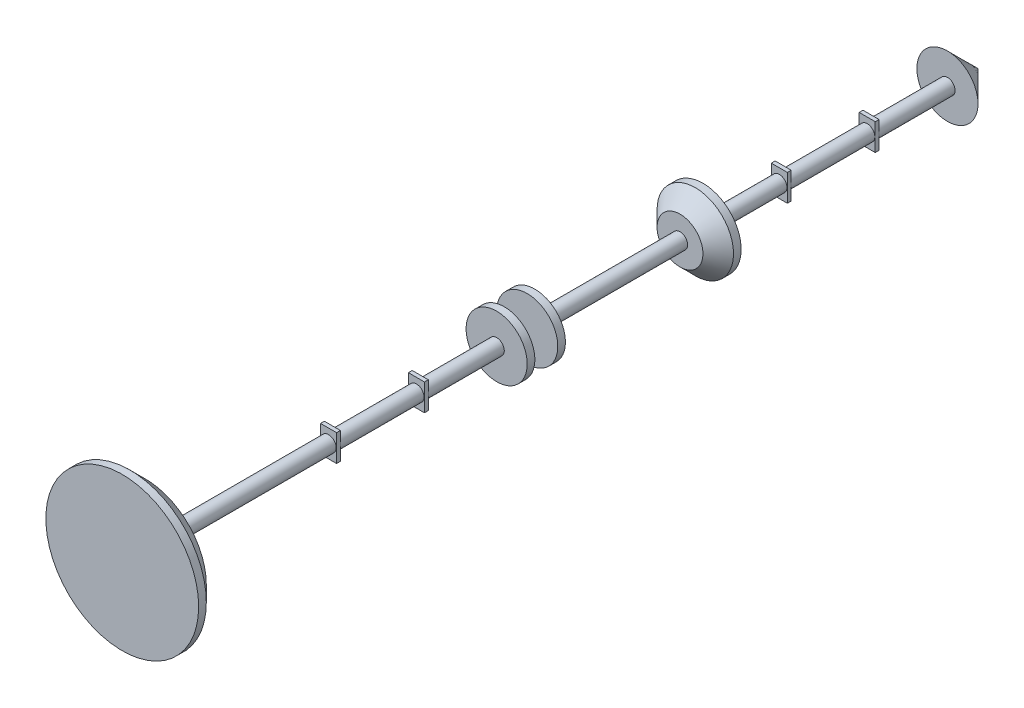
ISO-10303-21;
HEADER;
FILE_DESCRIPTION(('STEP AP214'),'2;1');
FILE_NAME('part.step','',(''),(''),'','','');
FILE_SCHEMA(('AUTOMOTIVE_DESIGN { 1 0 10303 214 1 1 1 1 }'));
ENDSEC;
DATA;
#1=APPLICATION_CONTEXT('core data for automotive mechanical design processes');
#2=APPLICATION_PROTOCOL_DEFINITION('international standard','automotive_design',2000,#1);
#3=PRODUCT_CONTEXT('',#1,'mechanical');
#4=PRODUCT('Part','Part','',(#3));
#5=PRODUCT_RELATED_PRODUCT_CATEGORY('part','',(#4));
#6=PRODUCT_DEFINITION_FORMATION('','',#4);
#7=PRODUCT_DEFINITION_CONTEXT('part definition',#1,'design');
#8=PRODUCT_DEFINITION('design','',#6,#7);
#9=PRODUCT_DEFINITION_SHAPE('','',#8);
#10=(LENGTH_UNIT() NAMED_UNIT(*) SI_UNIT(.MILLI.,.METRE.));
#11=(NAMED_UNIT(*) PLANE_ANGLE_UNIT() SI_UNIT($,.RADIAN.));
#12=(NAMED_UNIT(*) SI_UNIT($,.STERADIAN.) SOLID_ANGLE_UNIT());
#13=UNCERTAINTY_MEASURE_WITH_UNIT(LENGTH_MEASURE(1.E-05),#10,'distance_accuracy_value','');
#14=(GEOMETRIC_REPRESENTATION_CONTEXT(3) GLOBAL_UNCERTAINTY_ASSIGNED_CONTEXT((#13)) GLOBAL_UNIT_ASSIGNED_CONTEXT((#10,
#11,#12)) REPRESENTATION_CONTEXT('',''));
#15=CARTESIAN_POINT('',(0.,0.,0.));
#16=DIRECTION('',(0.,0.,1.));
#17=DIRECTION('',(1.,0.,0.));
#18=AXIS2_PLACEMENT_3D('',#15,#16,#17);
#19=CARTESIAN_POINT('',(0.,0.,-260.));
#20=DIRECTION('',(0.,0.,-1.));
#21=DIRECTION('',(-1.,0.,0.));
#22=AXIS2_PLACEMENT_3D('',#19,#20,#21);
#23=PLANE('',#22);
#24=CARTESIAN_POINT('',(0.,0.,-260.));
#25=DIRECTION('',(0.,0.,-1.));
#26=DIRECTION('',(-1.,0.,0.));
#27=AXIS2_PLACEMENT_3D('',#24,#25,#26);
#28=CIRCLE('',#27,40.);
#29=CARTESIAN_POINT('',(-40.,0.,-260.));
#30=VERTEX_POINT('',#29);
#31=EDGE_CURVE('E413',#30,#30,#28,.T.);
#32=ORIENTED_EDGE('',*,*,#31,.F.);
#33=EDGE_LOOP('',(#32));
#34=FACE_BOUND('',#33,.T.);
#35=ADVANCED_FACE('F42',(#34),#23,.F.);
#36=CARTESIAN_POINT('',(-10.5,-17.5,-710.));
#37=DIRECTION('',(0.,0.,-1.));
#38=DIRECTION('',(-1.,0.,0.));
#39=AXIS2_PLACEMENT_3D('',#36,#37,#38);
#40=PLANE('',#39);
#41=DIRECTION('',(-1.,0.,0.));
#42=VECTOR('',#41,1.);
#43=CARTESIAN_POINT('',(10.5,-17.5,-710.));
#44=LINE('',#43,#42);
#45=CARTESIAN_POINT('',(10.5,-17.5,-710.));
#46=VERTEX_POINT('',#45);
#47=CARTESIAN_POINT('',(-10.5,-17.5,-710.));
#48=VERTEX_POINT('',#47);
#49=EDGE_CURVE('E120',#46,#48,#44,.T.);
#50=ORIENTED_EDGE('',*,*,#49,.T.);
#51=DIRECTION('',(0.,1.,0.));
#52=VECTOR('',#51,1.);
#53=CARTESIAN_POINT('',(-10.5,-17.5,-710.));
#54=LINE('',#53,#52);
#55=CARTESIAN_POINT('',(-10.5,17.5,-710.));
#56=VERTEX_POINT('',#55);
#57=EDGE_CURVE('E112',#48,#56,#54,.T.);
#58=ORIENTED_EDGE('',*,*,#57,.T.);
#59=DIRECTION('',(1.,0.,0.));
#60=VECTOR('',#59,1.);
#61=CARTESIAN_POINT('',(-10.5,17.5,-710.));
#62=LINE('',#61,#60);
#63=CARTESIAN_POINT('',(10.5,17.5,-710.));
#64=VERTEX_POINT('',#63);
#65=EDGE_CURVE('E117',#56,#64,#62,.T.);
#66=ORIENTED_EDGE('',*,*,#65,.T.);
#67=DIRECTION('',(0.,-1.,0.));
#68=VECTOR('',#67,1.);
#69=CARTESIAN_POINT('',(10.5,17.5,-710.));
#70=LINE('',#69,#68);
#71=EDGE_CURVE('E133',#64,#46,#70,.T.);
#72=ORIENTED_EDGE('',*,*,#71,.T.);
#73=EDGE_LOOP('',(#50,#58,#66,#72));
#74=FACE_BOUND('',#73,.T.);
#75=CARTESIAN_POINT('',(0.,0.,-710.));
#76=DIRECTION('',(0.,0.,-1.));
#77=DIRECTION('',(-1.,0.,0.));
#78=AXIS2_PLACEMENT_3D('',#75,#76,#77);
#79=CIRCLE('',#78,10.);
#80=CARTESIAN_POINT('',(-10.,0.,-710.));
#81=VERTEX_POINT('',#80);
#82=EDGE_CURVE('E153',#81,#81,#79,.T.);
#83=ORIENTED_EDGE('',*,*,#82,.F.);
#84=EDGE_LOOP('',(#83));
#85=FACE_BOUND('',#84,.T.);
#86=ADVANCED_FACE('F114',(#74,#85),#40,.T.);
#87=CARTESIAN_POINT('',(-10.5,-17.5,-595.));
#88=DIRECTION('',(0.,0.,1.));
#89=DIRECTION('',(1.,0.,0.));
#90=AXIS2_PLACEMENT_3D('',#87,#88,#89);
#91=PLANE('',#90);
#92=DIRECTION('',(0.,1.,0.));
#93=VECTOR('',#92,1.);
#94=CARTESIAN_POINT('',(-10.5,-17.5,-595.));
#95=LINE('',#94,#93);
#96=CARTESIAN_POINT('',(-10.5,-17.5,-595.));
#97=VERTEX_POINT('',#96);
#98=CARTESIAN_POINT('',(-10.5,17.5,-595.));
#99=VERTEX_POINT('',#98);
#100=EDGE_CURVE('E135',#97,#99,#95,.T.);
#101=ORIENTED_EDGE('',*,*,#100,.T.);
#102=DIRECTION('',(1.,0.,0.));
#103=VECTOR('',#102,1.);
#104=CARTESIAN_POINT('',(-10.5,17.5,-595.));
#105=LINE('',#104,#103);
#106=CARTESIAN_POINT('',(10.5,17.5,-595.));
#107=VERTEX_POINT('',#106);
#108=EDGE_CURVE('E453',#99,#107,#105,.T.);
#109=ORIENTED_EDGE('',*,*,#108,.T.);
#110=DIRECTION('',(0.,-1.,0.));
#111=VECTOR('',#110,1.);
#112=CARTESIAN_POINT('',(10.5,17.5,-595.));
#113=LINE('',#112,#111);
#114=CARTESIAN_POINT('',(10.5,-17.5,-595.));
#115=VERTEX_POINT('',#114);
#116=EDGE_CURVE('E450',#107,#115,#113,.T.);
#117=ORIENTED_EDGE('',*,*,#116,.T.);
#118=DIRECTION('',(-1.,0.,0.));
#119=VECTOR('',#118,1.);
#120=CARTESIAN_POINT('',(10.5,-17.5,-595.));
#121=LINE('',#120,#119);
#122=EDGE_CURVE('E428',#115,#97,#121,.T.);
#123=ORIENTED_EDGE('',*,*,#122,.T.);
#124=EDGE_LOOP('',(#101,#109,#117,#123));
#125=FACE_BOUND('',#124,.T.);
#126=CARTESIAN_POINT('',(0.,0.,-595.));
#127=DIRECTION('',(0.,0.,1.));
#128=DIRECTION('',(1.,0.,0.));
#129=AXIS2_PLACEMENT_3D('',#126,#127,#128);
#130=CIRCLE('',#129,10.);
#131=CARTESIAN_POINT('',(10.,0.,-595.));
#132=VERTEX_POINT('',#131);
#133=EDGE_CURVE('E445',#132,#132,#130,.F.);
#134=ORIENTED_EDGE('',*,*,#133,.F.);
#135=EDGE_LOOP('',(#134));
#136=FACE_BOUND('',#135,.T.);
#137=ADVANCED_FACE('F180',(#125,#136),#91,.F.);
#138=CARTESIAN_POINT('',(0.,0.,-490.));
#139=DIRECTION('',(0.,0.,-1.));
#140=DIRECTION('',(-1.,0.,0.));
#141=AXIS2_PLACEMENT_3D('',#138,#139,#140);
#142=PLANE('',#141);
#143=CARTESIAN_POINT('',(0.,0.,-490.));
#144=DIRECTION('',(0.,0.,-1.));
#145=DIRECTION('',(-1.,0.,0.));
#146=AXIS2_PLACEMENT_3D('',#143,#144,#145);
#147=CIRCLE('',#146,50.);
#148=CARTESIAN_POINT('',(-50.,0.,-490.));
#149=VERTEX_POINT('',#148);
#150=EDGE_CURVE('E419',#149,#149,#147,.T.);
#151=ORIENTED_EDGE('',*,*,#150,.T.);
#152=EDGE_LOOP('',(#151));
#153=FACE_BOUND('',#152,.T.);
#154=CARTESIAN_POINT('',(0.,0.,-490.));
#155=DIRECTION('',(0.,0.,-1.));
#156=DIRECTION('',(-1.,0.,0.));
#157=AXIS2_PLACEMENT_3D('',#154,#155,#156);
#158=CIRCLE('',#157,10.);
#159=CARTESIAN_POINT('',(-10.,0.,-490.));
#160=VERTEX_POINT('',#159);
#161=EDGE_CURVE('E424',#160,#160,#158,.T.);
#162=ORIENTED_EDGE('',*,*,#161,.F.);
#163=EDGE_LOOP('',(#162));
#164=FACE_BOUND('',#163,.T.);
#165=ADVANCED_FACE('F195',(#153,#164),#142,.T.);
#166=CARTESIAN_POINT('',(0.,0.,-270.));
#167=DIRECTION('',(0.,0.,-1.));
#168=DIRECTION('',(-1.,0.,0.));
#169=AXIS2_PLACEMENT_3D('',#166,#167,#168);
#170=PLANE('',#169);
#171=CARTESIAN_POINT('',(0.,0.,-270.));
#172=DIRECTION('',(0.,0.,-1.));
#173=DIRECTION('',(-1.,0.,0.));
#174=AXIS2_PLACEMENT_3D('',#171,#172,#173);
#175=CIRCLE('',#174,40.);
#176=CARTESIAN_POINT('',(-40.,0.,-270.));
#177=VERTEX_POINT('',#176);
#178=EDGE_CURVE('E411',#177,#177,#175,.T.);
#179=ORIENTED_EDGE('',*,*,#178,.T.);
#180=EDGE_LOOP('',(#179));
#181=FACE_BOUND('',#180,.T.);
#182=CARTESIAN_POINT('',(0.,0.,-270.));
#183=DIRECTION('',(0.,0.,-1.));
#184=DIRECTION('',(-1.,0.,0.));
#185=AXIS2_PLACEMENT_3D('',#182,#183,#184);
#186=CIRCLE('',#185,10.);
#187=CARTESIAN_POINT('',(-10.,0.,-270.));
#188=VERTEX_POINT('',#187);
#189=EDGE_CURVE('E414',#188,#188,#186,.T.);
#190=ORIENTED_EDGE('',*,*,#189,.F.);
#191=EDGE_LOOP('',(#190));
#192=FACE_BOUND('',#191,.T.);
#193=ADVANCED_FACE('F185',(#181,#192),#170,.T.);
#194=CARTESIAN_POINT('',(0.,0.,-270.));
#195=DIRECTION('',(0.,0.,1.));
#196=DIRECTION('',(1.,0.,0.));
#197=AXIS2_PLACEMENT_3D('',#194,#195,#196);
#198=CYLINDRICAL_SURFACE('',#197,40.);
#199=ORIENTED_EDGE('',*,*,#178,.F.);
#200=EDGE_LOOP('',(#199));
#201=FACE_BOUND('',#200,.T.);
#202=ORIENTED_EDGE('',*,*,#31,.T.);
#203=EDGE_LOOP('',(#202));
#204=FACE_BOUND('',#203,.T.);
#205=ADVANCED_FACE('F190',(#201,#204),#198,.T.);
#206=CARTESIAN_POINT('',(0.,0.,-460.));
#207=DIRECTION('',(0.,0.,1.));
#208=DIRECTION('',(1.,0.,0.));
#209=AXIS2_PLACEMENT_3D('',#206,#207,#208);
#210=CYLINDRICAL_SURFACE('',#209,10.);
#211=CARTESIAN_POINT('',(0.,0.,-460.));
#212=DIRECTION('',(0.,0.,-1.));
#213=DIRECTION('',(-1.,0.,0.));
#214=AXIS2_PLACEMENT_3D('',#211,#212,#213);
#215=CIRCLE('',#214,10.);
#216=CARTESIAN_POINT('',(-10.,0.,-460.));
#217=VERTEX_POINT('',#216);
#218=EDGE_CURVE('E417',#217,#217,#215,.T.);
#219=ORIENTED_EDGE('',*,*,#218,.F.);
#220=EDGE_LOOP('',(#219));
#221=FACE_BOUND('',#220,.T.);
#222=ORIENTED_EDGE('',*,*,#189,.T.);
#223=EDGE_LOOP('',(#222));
#224=FACE_BOUND('',#223,.T.);
#225=ADVANCED_FACE('F186',(#221,#224),#210,.T.);
#226=CARTESIAN_POINT('',(0.,0.,-460.));
#227=DIRECTION('',(0.,0.,-1.));
#228=DIRECTION('',(-1.,0.,0.));
#229=AXIS2_PLACEMENT_3D('',#226,#227,#228);
#230=PLANE('',#229);
#231=CARTESIAN_POINT('',(0.,0.,-460.));
#232=DIRECTION('',(0.,0.,-1.));
#233=DIRECTION('',(-1.,0.,0.));
#234=AXIS2_PLACEMENT_3D('',#231,#232,#233);
#235=CIRCLE('',#234,30.);
#236=CARTESIAN_POINT('',(-30.,0.,-460.));
#237=VERTEX_POINT('',#236);
#238=EDGE_CURVE('E12',#237,#237,#235,.F.);
#239=ORIENTED_EDGE('',*,*,#238,.T.);
#240=EDGE_LOOP('',(#239));
#241=FACE_BOUND('',#240,.T.);
#242=ORIENTED_EDGE('',*,*,#218,.T.);
#243=EDGE_LOOP('',(#242));
#244=FACE_BOUND('',#243,.T.);
#245=ADVANCED_FACE('F189',(#241,#244),#230,.F.);
#246=CARTESIAN_POINT('',(0.,0.,-490.));
#247=DIRECTION('',(0.,0.,1.));
#248=DIRECTION('',(1.,0.,0.));
#249=AXIS2_PLACEMENT_3D('',#246,#247,#248);
#250=CYLINDRICAL_SURFACE('',#249,50.);
#251=CARTESIAN_POINT('',(0.,0.,-480.));
#252=DIRECTION('',(0.,0.,-1.));
#253=DIRECTION('',(-1.,0.,0.));
#254=AXIS2_PLACEMENT_3D('',#251,#252,#253);
#255=CIRCLE('',#254,50.);
#256=CARTESIAN_POINT('',(-50.,0.,-480.));
#257=VERTEX_POINT('',#256);
#258=EDGE_CURVE('E50',#257,#257,#255,.T.);
#259=ORIENTED_EDGE('',*,*,#258,.T.);
#260=EDGE_LOOP('',(#259));
#261=FACE_BOUND('',#260,.T.);
#262=ORIENTED_EDGE('',*,*,#150,.F.);
#263=EDGE_LOOP('',(#262));
#264=FACE_BOUND('',#263,.T.);
#265=ADVANCED_FACE('F160',(#261,#264),#250,.T.);
#266=CARTESIAN_POINT('',(0.,0.,-590.));
#267=DIRECTION('',(0.,0.,1.));
#268=DIRECTION('',(1.,0.,0.));
#269=AXIS2_PLACEMENT_3D('',#266,#267,#268);
#270=CYLINDRICAL_SURFACE('',#269,10.);
#271=CARTESIAN_POINT('',(0.,0.,-590.));
#272=DIRECTION('',(0.,0.,-1.));
#273=DIRECTION('',(-1.,0.,0.));
#274=AXIS2_PLACEMENT_3D('',#271,#272,#273);
#275=CIRCLE('',#274,10.);
#276=CARTESIAN_POINT('',(-10.,0.,-590.));
#277=VERTEX_POINT('',#276);
#278=EDGE_CURVE('E429',#277,#277,#275,.T.);
#279=ORIENTED_EDGE('',*,*,#278,.F.);
#280=EDGE_LOOP('',(#279));
#281=FACE_BOUND('',#280,.T.);
#282=ORIENTED_EDGE('',*,*,#161,.T.);
#283=EDGE_LOOP('',(#282));
#284=FACE_BOUND('',#283,.T.);
#285=ADVANCED_FACE('F194',(#281,#284),#270,.T.);
#286=CARTESIAN_POINT('',(-10.5,-17.5,-590.));
#287=DIRECTION('',(0.,0.,1.));
#288=DIRECTION('',(1.,0.,0.));
#289=AXIS2_PLACEMENT_3D('',#286,#287,#288);
#290=PLANE('',#289);
#291=DIRECTION('',(0.,1.,0.));
#292=VECTOR('',#291,1.);
#293=CARTESIAN_POINT('',(-10.5,-17.5,-590.));
#294=LINE('',#293,#292);
#295=CARTESIAN_POINT('',(-10.5,-17.5,-590.));
#296=VERTEX_POINT('',#295);
#297=CARTESIAN_POINT('',(-10.5,17.5,-590.));
#298=VERTEX_POINT('',#297);
#299=EDGE_CURVE('E432',#296,#298,#294,.T.);
#300=ORIENTED_EDGE('',*,*,#299,.F.);
#301=DIRECTION('',(-1.,0.,0.));
#302=VECTOR('',#301,1.);
#303=CARTESIAN_POINT('',(10.5,-17.5,-590.));
#304=LINE('',#303,#302);
#305=CARTESIAN_POINT('',(10.5,-17.5,-590.));
#306=VERTEX_POINT('',#305);
#307=EDGE_CURVE('E86',#306,#296,#304,.T.);
#308=ORIENTED_EDGE('',*,*,#307,.F.);
#309=DIRECTION('',(0.,-1.,0.));
#310=VECTOR('',#309,1.);
#311=CARTESIAN_POINT('',(10.5,17.5,-590.));
#312=LINE('',#311,#310);
#313=CARTESIAN_POINT('',(10.5,17.5,-590.));
#314=VERTEX_POINT('',#313);
#315=EDGE_CURVE('E438',#314,#306,#312,.T.);
#316=ORIENTED_EDGE('',*,*,#315,.F.);
#317=DIRECTION('',(1.,0.,0.));
#318=VECTOR('',#317,1.);
#319=CARTESIAN_POINT('',(-10.5,17.5,-590.));
#320=LINE('',#319,#318);
#321=EDGE_CURVE('E439',#298,#314,#320,.T.);
#322=ORIENTED_EDGE('',*,*,#321,.F.);
#323=EDGE_LOOP('',(#300,#308,#316,#322));
#324=FACE_BOUND('',#323,.T.);
#325=ORIENTED_EDGE('',*,*,#278,.T.);
#326=EDGE_LOOP('',(#325));
#327=FACE_BOUND('',#326,.T.);
#328=ADVANCED_FACE('F204',(#324,#327),#290,.T.);
#329=CARTESIAN_POINT('',(-10.5,-17.5,-595.));
#330=DIRECTION('',(1.,0.,0.));
#331=DIRECTION('',(0.,1.,0.));
#332=AXIS2_PLACEMENT_3D('',#329,#330,#331);
#333=PLANE('',#332);
#334=ORIENTED_EDGE('',*,*,#299,.T.);
#335=DIRECTION('',(0.,0.,1.));
#336=VECTOR('',#335,1.);
#337=CARTESIAN_POINT('',(-10.5,17.5,-595.));
#338=LINE('',#337,#336);
#339=EDGE_CURVE('E435',#99,#298,#338,.T.);
#340=ORIENTED_EDGE('',*,*,#339,.F.);
#341=ORIENTED_EDGE('',*,*,#100,.F.);
#342=DIRECTION('',(0.,0.,1.));
#343=VECTOR('',#342,1.);
#344=CARTESIAN_POINT('',(-10.5,-17.5,-595.));
#345=LINE('',#344,#343);
#346=EDGE_CURVE('E446',#97,#296,#345,.T.);
#347=ORIENTED_EDGE('',*,*,#346,.T.);
#348=EDGE_LOOP('',(#334,#340,#341,#347));
#349=FACE_BOUND('',#348,.T.);
#350=ADVANCED_FACE('F206',(#349),#333,.F.);
#351=CARTESIAN_POINT('',(-10.5,17.5,-595.));
#352=DIRECTION('',(0.,-1.,0.));
#353=DIRECTION('',(1.,0.,0.));
#354=AXIS2_PLACEMENT_3D('',#351,#352,#353);
#355=PLANE('',#354);
#356=ORIENTED_EDGE('',*,*,#321,.T.);
#357=DIRECTION('',(0.,0.,1.));
#358=VECTOR('',#357,1.);
#359=CARTESIAN_POINT('',(10.5,17.5,-595.));
#360=LINE('',#359,#358);
#361=EDGE_CURVE('E440',#107,#314,#360,.T.);
#362=ORIENTED_EDGE('',*,*,#361,.F.);
#363=ORIENTED_EDGE('',*,*,#108,.F.);
#364=ORIENTED_EDGE('',*,*,#339,.T.);
#365=EDGE_LOOP('',(#356,#362,#363,#364));
#366=FACE_BOUND('',#365,.T.);
#367=ADVANCED_FACE('F209',(#366),#355,.F.);
#368=CARTESIAN_POINT('',(10.5,17.5,-595.));
#369=DIRECTION('',(-1.,0.,0.));
#370=DIRECTION('',(0.,-1.,0.));
#371=AXIS2_PLACEMENT_3D('',#368,#369,#370);
#372=PLANE('',#371);
#373=ORIENTED_EDGE('',*,*,#315,.T.);
#374=DIRECTION('',(0.,0.,1.));
#375=VECTOR('',#374,1.);
#376=CARTESIAN_POINT('',(10.5,-17.5,-595.));
#377=LINE('',#376,#375);
#378=EDGE_CURVE('E443',#115,#306,#377,.T.);
#379=ORIENTED_EDGE('',*,*,#378,.F.);
#380=ORIENTED_EDGE('',*,*,#116,.F.);
#381=ORIENTED_EDGE('',*,*,#361,.T.);
#382=EDGE_LOOP('',(#373,#379,#380,#381));
#383=FACE_BOUND('',#382,.T.);
#384=ADVANCED_FACE('F213',(#383),#372,.F.);
#385=CARTESIAN_POINT('',(10.5,-17.5,-595.));
#386=DIRECTION('',(0.,1.,0.));
#387=DIRECTION('',(-1.,0.,0.));
#388=AXIS2_PLACEMENT_3D('',#385,#386,#387);
#389=PLANE('',#388);
#390=ORIENTED_EDGE('',*,*,#307,.T.);
#391=ORIENTED_EDGE('',*,*,#346,.F.);
#392=ORIENTED_EDGE('',*,*,#122,.F.);
#393=ORIENTED_EDGE('',*,*,#378,.T.);
#394=EDGE_LOOP('',(#390,#391,#392,#393));
#395=FACE_BOUND('',#394,.T.);
#396=ADVANCED_FACE('F217',(#395),#389,.F.);
#397=CARTESIAN_POINT('',(0.,0.,-705.));
#398=DIRECTION('',(0.,0.,1.));
#399=DIRECTION('',(1.,0.,0.));
#400=AXIS2_PLACEMENT_3D('',#397,#398,#399);
#401=CYLINDRICAL_SURFACE('',#400,10.);
#402=CARTESIAN_POINT('',(0.,0.,-705.));
#403=DIRECTION('',(0.,0.,-1.));
#404=DIRECTION('',(-1.,0.,0.));
#405=AXIS2_PLACEMENT_3D('',#402,#403,#404);
#406=CIRCLE('',#405,10.);
#407=CARTESIAN_POINT('',(-10.,0.,-705.));
#408=VERTEX_POINT('',#407);
#409=EDGE_CURVE('E148',#408,#408,#406,.T.);
#410=ORIENTED_EDGE('',*,*,#409,.F.);
#411=EDGE_LOOP('',(#410));
#412=FACE_BOUND('',#411,.T.);
#413=ORIENTED_EDGE('',*,*,#133,.T.);
#414=EDGE_LOOP('',(#413));
#415=FACE_BOUND('',#414,.T.);
#416=ADVANCED_FACE('F221',(#412,#415),#401,.T.);
#417=CARTESIAN_POINT('',(-10.5,-17.5,-705.));
#418=DIRECTION('',(0.,0.,-1.));
#419=DIRECTION('',(-1.,0.,0.));
#420=AXIS2_PLACEMENT_3D('',#417,#418,#419);
#421=PLANE('',#420);
#422=DIRECTION('',(-1.,0.,0.));
#423=VECTOR('',#422,1.);
#424=CARTESIAN_POINT('',(10.5,-17.5,-705.));
#425=LINE('',#424,#423);
#426=CARTESIAN_POINT('',(10.5,-17.5,-705.));
#427=VERTEX_POINT('',#426);
#428=CARTESIAN_POINT('',(-10.5,-17.5,-705.));
#429=VERTEX_POINT('',#428);
#430=EDGE_CURVE('E145',#427,#429,#425,.T.);
#431=ORIENTED_EDGE('',*,*,#430,.F.);
#432=DIRECTION('',(0.,-1.,0.));
#433=VECTOR('',#432,1.);
#434=CARTESIAN_POINT('',(10.5,17.5,-705.));
#435=LINE('',#434,#433);
#436=CARTESIAN_POINT('',(10.5,17.5,-705.));
#437=VERTEX_POINT('',#436);
#438=EDGE_CURVE('E61',#437,#427,#435,.T.);
#439=ORIENTED_EDGE('',*,*,#438,.F.);
#440=DIRECTION('',(1.,0.,0.));
#441=VECTOR('',#440,1.);
#442=CARTESIAN_POINT('',(-10.5,17.5,-705.));
#443=LINE('',#442,#441);
#444=CARTESIAN_POINT('',(-10.5,17.5,-705.));
#445=VERTEX_POINT('',#444);
#446=EDGE_CURVE('E128',#445,#437,#443,.T.);
#447=ORIENTED_EDGE('',*,*,#446,.F.);
#448=DIRECTION('',(0.,1.,0.));
#449=VECTOR('',#448,1.);
#450=CARTESIAN_POINT('',(-10.5,-17.5,-705.));
#451=LINE('',#450,#449);
#452=EDGE_CURVE('E77',#429,#445,#451,.T.);
#453=ORIENTED_EDGE('',*,*,#452,.F.);
#454=EDGE_LOOP('',(#431,#439,#447,#453));
#455=FACE_BOUND('',#454,.T.);
#456=ORIENTED_EDGE('',*,*,#409,.T.);
#457=EDGE_LOOP('',(#456));
#458=FACE_BOUND('',#457,.T.);
#459=ADVANCED_FACE('F230',(#455,#458),#421,.F.);
#460=CARTESIAN_POINT('',(10.5,-17.5,-710.));
#461=DIRECTION('',(0.,1.,0.));
#462=DIRECTION('',(-1.,0.,0.));
#463=AXIS2_PLACEMENT_3D('',#460,#461,#462);
#464=PLANE('',#463);
#465=ORIENTED_EDGE('',*,*,#430,.T.);
#466=DIRECTION('',(0.,0.,1.));
#467=VECTOR('',#466,1.);
#468=CARTESIAN_POINT('',(-10.5,-17.5,-710.));
#469=LINE('',#468,#467);
#470=EDGE_CURVE('E142',#48,#429,#469,.T.);
#471=ORIENTED_EDGE('',*,*,#470,.F.);
#472=ORIENTED_EDGE('',*,*,#49,.F.);
#473=DIRECTION('',(0.,0.,1.));
#474=VECTOR('',#473,1.);
#475=CARTESIAN_POINT('',(10.5,-17.5,-710.));
#476=LINE('',#475,#474);
#477=EDGE_CURVE('E144',#46,#427,#476,.T.);
#478=ORIENTED_EDGE('',*,*,#477,.T.);
#479=EDGE_LOOP('',(#465,#471,#472,#478));
#480=FACE_BOUND('',#479,.T.);
#481=ADVANCED_FACE('F232',(#480),#464,.F.);
#482=CARTESIAN_POINT('',(-10.5,-17.5,-710.));
#483=DIRECTION('',(1.,0.,0.));
#484=DIRECTION('',(0.,1.,0.));
#485=AXIS2_PLACEMENT_3D('',#482,#483,#484);
#486=PLANE('',#485);
#487=ORIENTED_EDGE('',*,*,#452,.T.);
#488=DIRECTION('',(0.,0.,1.));
#489=VECTOR('',#488,1.);
#490=CARTESIAN_POINT('',(-10.5,17.5,-710.));
#491=LINE('',#490,#489);
#492=EDGE_CURVE('E125',#56,#445,#491,.T.);
#493=ORIENTED_EDGE('',*,*,#492,.F.);
#494=ORIENTED_EDGE('',*,*,#57,.F.);
#495=ORIENTED_EDGE('',*,*,#470,.T.);
#496=EDGE_LOOP('',(#487,#493,#494,#495));
#497=FACE_BOUND('',#496,.T.);
#498=ADVANCED_FACE('F126',(#497),#486,.F.);
#499=CARTESIAN_POINT('',(-10.5,17.5,-710.));
#500=DIRECTION('',(0.,-1.,0.));
#501=DIRECTION('',(1.,0.,0.));
#502=AXIS2_PLACEMENT_3D('',#499,#500,#501);
#503=PLANE('',#502);
#504=ORIENTED_EDGE('',*,*,#446,.T.);
#505=DIRECTION('',(0.,0.,1.));
#506=VECTOR('',#505,1.);
#507=CARTESIAN_POINT('',(10.5,17.5,-710.));
#508=LINE('',#507,#506);
#509=EDGE_CURVE('E131',#64,#437,#508,.T.);
#510=ORIENTED_EDGE('',*,*,#509,.F.);
#511=ORIENTED_EDGE('',*,*,#65,.F.);
#512=ORIENTED_EDGE('',*,*,#492,.T.);
#513=EDGE_LOOP('',(#504,#510,#511,#512));
#514=FACE_BOUND('',#513,.T.);
#515=ADVANCED_FACE('F130',(#514),#503,.F.);
#516=CARTESIAN_POINT('',(10.5,17.5,-710.));
#517=DIRECTION('',(-1.,0.,0.));
#518=DIRECTION('',(0.,-1.,0.));
#519=AXIS2_PLACEMENT_3D('',#516,#517,#518);
#520=PLANE('',#519);
#521=ORIENTED_EDGE('',*,*,#438,.T.);
#522=ORIENTED_EDGE('',*,*,#477,.F.);
#523=ORIENTED_EDGE('',*,*,#71,.F.);
#524=ORIENTED_EDGE('',*,*,#509,.T.);
#525=EDGE_LOOP('',(#521,#522,#523,#524));
#526=FACE_BOUND('',#525,.T.);
#527=ADVANCED_FACE('F240',(#526),#520,.F.);
#528=CARTESIAN_POINT('',(0.,0.,-810.));
#529=DIRECTION('',(0.,0.,1.));
#530=DIRECTION('',(1.,0.,0.));
#531=AXIS2_PLACEMENT_3D('',#528,#529,#530);
#532=CYLINDRICAL_SURFACE('',#531,10.);
#533=CARTESIAN_POINT('',(0.,0.,-810.));
#534=DIRECTION('',(0.,0.,-1.));
#535=DIRECTION('',(-1.,0.,0.));
#536=AXIS2_PLACEMENT_3D('',#533,#534,#535);
#537=CIRCLE('',#536,10.);
#538=CARTESIAN_POINT('',(-10.,0.,-810.));
#539=VERTEX_POINT('',#538);
#540=EDGE_CURVE('E149',#539,#539,#537,.T.);
#541=ORIENTED_EDGE('',*,*,#540,.F.);
#542=EDGE_LOOP('',(#541));
#543=FACE_BOUND('',#542,.T.);
#544=ORIENTED_EDGE('',*,*,#82,.T.);
#545=EDGE_LOOP('',(#544));
#546=FACE_BOUND('',#545,.T.);
#547=ADVANCED_FACE('F242',(#543,#546),#532,.T.);
#548=CARTESIAN_POINT('',(-40.,0.,-810.));
#549=DIRECTION('',(0.,0.,-1.));
#550=DIRECTION('',(-1.,0.,0.));
#551=AXIS2_PLACEMENT_3D('',#548,#549,#550);
#552=PLANE('',#551);
#553=CARTESIAN_POINT('',(0.,0.,-810.));
#554=DIRECTION('',(0.,0.,1.));
#555=DIRECTION('',(1.,0.,0.));
#556=AXIS2_PLACEMENT_3D('',#553,#554,#555);
#557=CIRCLE('',#556,40.);
#558=CARTESIAN_POINT('',(40.,0.,-810.));
#559=VERTEX_POINT('',#558);
#560=EDGE_CURVE('E152',#559,#559,#557,.T.);
#561=ORIENTED_EDGE('',*,*,#560,.T.);
#562=EDGE_LOOP('',(#561));
#563=FACE_BOUND('',#562,.T.);
#564=ORIENTED_EDGE('',*,*,#540,.T.);
#565=EDGE_LOOP('',(#564));
#566=FACE_BOUND('',#565,.T.);
#567=ADVANCED_FACE('F170',(#563,#566),#552,.F.);
#568=CARTESIAN_POINT('',(0.,0.,-850.));
#569=DIRECTION('',(0.,0.,1.));
#570=DIRECTION('',(1.,0.,0.));
#571=AXIS2_PLACEMENT_3D('',#568,#569,#570);
#572=CONICAL_SURFACE('',#571,0.,0.785398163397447);
#573=ORIENTED_EDGE('',*,*,#560,.F.);
#574=EDGE_LOOP('',(#573));
#575=FACE_BOUND('',#574,.T.);
#576=CARTESIAN_POINT('',(0.,0.,-850.));
#577=VERTEX_POINT('',#576);
#578=VERTEX_LOOP('',#577);
#579=FACE_BOUND('',#578,.T.);
#580=ADVANCED_FACE('F44',(#575,#579),#572,.T.);
#581=CARTESIAN_POINT('',(0.,0.,-480.));
#582=DIRECTION('',(0.,0.,-1.));
#583=DIRECTION('',(-1.,0.,0.));
#584=AXIS2_PLACEMENT_3D('',#581,#582,#583);
#585=CONICAL_SURFACE('',#584,50.,0.78539816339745);
#586=ORIENTED_EDGE('',*,*,#238,.F.);
#587=EDGE_LOOP('',(#586));
#588=FACE_BOUND('',#587,.T.);
#589=ORIENTED_EDGE('',*,*,#258,.F.);
#590=EDGE_LOOP('',(#589));
#591=FACE_BOUND('',#590,.T.);
#592=ADVANCED_FACE('F163',(#588,#591),#585,.T.);
#593=CLOSED_SHELL('',(#35,#86,#137,#165,#193,#205,#225,#245,#265,#285,#328,#350,#367,#384,#396,
#416,#459,#481,#498,#515,#527,#547,#567,#580,#592));
#594=MANIFOLD_SOLID_BREP('B2',#593);
#595=CARTESIAN_POINT('',(0.,0.,270.));
#596=DIRECTION('',(0.,0.,1.));
#597=DIRECTION('',(1.,0.,0.));
#598=AXIS2_PLACEMENT_3D('',#595,#596,#597);
#599=PLANE('',#598);
#600=CARTESIAN_POINT('',(0.,0.,270.));
#601=DIRECTION('',(0.,0.,1.));
#602=DIRECTION('',(1.,0.,0.));
#603=AXIS2_PLACEMENT_3D('',#600,#601,#602);
#604=CIRCLE('',#603,100.);
#605=CARTESIAN_POINT('',(100.,0.,270.));
#606=VERTEX_POINT('',#605);
#607=EDGE_CURVE('E883',#606,#606,#604,.T.);
#608=ORIENTED_EDGE('',*,*,#607,.T.);
#609=EDGE_LOOP('',(#608));
#610=FACE_BOUND('',#609,.T.);
#611=ADVANCED_FACE('F497',(#610),#599,.T.);
#612=CARTESIAN_POINT('',(0.,0.,270.));
#613=DIRECTION('',(0.,0.,-1.));
#614=DIRECTION('',(-1.,0.,0.));
#615=AXIS2_PLACEMENT_3D('',#612,#613,#614);
#616=CYLINDRICAL_SURFACE('',#615,100.);
#617=CARTESIAN_POINT('',(0.,0.,260.));
#618=DIRECTION('',(0.,0.,1.));
#619=DIRECTION('',(1.,0.,0.));
#620=AXIS2_PLACEMENT_3D('',#617,#618,#619);
#621=CIRCLE('',#620,100.);
#622=CARTESIAN_POINT('',(100.,0.,260.));
#623=VERTEX_POINT('',#622);
#624=EDGE_CURVE('E505',#623,#623,#621,.T.);
#625=ORIENTED_EDGE('',*,*,#624,.T.);
#626=EDGE_LOOP('',(#625));
#627=FACE_BOUND('',#626,.T.);
#628=ORIENTED_EDGE('',*,*,#607,.F.);
#629=EDGE_LOOP('',(#628));
#630=FACE_BOUND('',#629,.T.);
#631=ADVANCED_FACE('F650',(#627,#630),#616,.T.);
#632=CARTESIAN_POINT('',(0.,0.,240.));
#633=DIRECTION('',(0.,0.,1.));
#634=DIRECTION('',(1.,0.,0.));
#635=AXIS2_PLACEMENT_3D('',#632,#633,#634);
#636=PLANE('',#635);
#637=CARTESIAN_POINT('',(0.,0.,240.));
#638=DIRECTION('',(0.,0.,1.));
#639=DIRECTION('',(1.,0.,0.));
#640=AXIS2_PLACEMENT_3D('',#637,#638,#639);
#641=CIRCLE('',#640,80.);
#642=CARTESIAN_POINT('',(80.,0.,240.));
#643=VERTEX_POINT('',#642);
#644=EDGE_CURVE('E40',#643,#643,#641,.F.);
#645=ORIENTED_EDGE('',*,*,#644,.T.);
#646=EDGE_LOOP('',(#645));
#647=FACE_BOUND('',#646,.T.);
#648=CARTESIAN_POINT('',(0.,0.,240.));
#649=DIRECTION('',(0.,0.,1.));
#650=DIRECTION('',(1.,0.,0.));
#651=AXIS2_PLACEMENT_3D('',#648,#649,#650);
#652=CIRCLE('',#651,10.);
#653=CARTESIAN_POINT('',(10.,0.,240.));
#654=VERTEX_POINT('',#653);
#655=EDGE_CURVE('E645',#654,#654,#652,.T.);
#656=ORIENTED_EDGE('',*,*,#655,.T.);
#657=EDGE_LOOP('',(#656));
#658=FACE_BOUND('',#657,.T.);
#659=ADVANCED_FACE('F672',(#647,#658),#636,.F.);
#660=CARTESIAN_POINT('',(0.,0.,240.));
#661=DIRECTION('',(0.,0.,-1.));
#662=DIRECTION('',(-1.,0.,0.));
#663=AXIS2_PLACEMENT_3D('',#660,#661,#662);
#664=CYLINDRICAL_SURFACE('',#663,10.);
#665=ORIENTED_EDGE('',*,*,#655,.F.);
#666=EDGE_LOOP('',(#665));
#667=FACE_BOUND('',#666,.T.);
#668=CARTESIAN_POINT('',(0.,0.,0.));
#669=DIRECTION('',(0.,0.,-1.));
#670=DIRECTION('',(-1.,0.,0.));
#671=AXIS2_PLACEMENT_3D('',#668,#669,#670);
#672=CIRCLE('',#671,10.);
#673=CARTESIAN_POINT('',(-10.,0.,0.));
#674=VERTEX_POINT('',#673);
#675=EDGE_CURVE('E642',#674,#674,#672,.T.);
#676=ORIENTED_EDGE('',*,*,#675,.F.);
#677=EDGE_LOOP('',(#676));
#678=FACE_BOUND('',#677,.T.);
#679=ADVANCED_FACE('F499',(#667,#678),#664,.T.);
#680=CARTESIAN_POINT('',(10.5,-17.5,0.));
#681=DIRECTION('',(0.,0.,-1.));
#682=DIRECTION('',(-1.,0.,0.));
#683=AXIS2_PLACEMENT_3D('',#680,#681,#682);
#684=PLANE('',#683);
#685=DIRECTION('',(0.,-1.,0.));
#686=VECTOR('',#685,1.);
#687=CARTESIAN_POINT('',(10.5,17.5,0.));
#688=LINE('',#687,#686);
#689=CARTESIAN_POINT('',(10.5,17.5,0.));
#690=VERTEX_POINT('',#689);
#691=CARTESIAN_POINT('',(10.5,-17.5,0.));
#692=VERTEX_POINT('',#691);
#693=EDGE_CURVE('E615',#690,#692,#688,.T.);
#694=ORIENTED_EDGE('',*,*,#693,.F.);
#695=DIRECTION('',(1.,0.,0.));
#696=VECTOR('',#695,1.);
#697=CARTESIAN_POINT('',(10.5,17.5,0.));
#698=LINE('',#697,#696);
#699=CARTESIAN_POINT('',(-10.5,17.5,0.));
#700=VERTEX_POINT('',#699);
#701=EDGE_CURVE('E622',#700,#690,#698,.T.);
#702=ORIENTED_EDGE('',*,*,#701,.F.);
#703=DIRECTION('',(0.,1.,0.));
#704=VECTOR('',#703,1.);
#705=CARTESIAN_POINT('',(-10.5,17.5,0.));
#706=LINE('',#705,#704);
#707=CARTESIAN_POINT('',(-10.5,-17.5,0.));
#708=VERTEX_POINT('',#707);
#709=EDGE_CURVE('E620',#708,#700,#706,.T.);
#710=ORIENTED_EDGE('',*,*,#709,.F.);
#711=DIRECTION('',(-1.,0.,0.));
#712=VECTOR('',#711,1.);
#713=CARTESIAN_POINT('',(10.5,-17.5,0.));
#714=LINE('',#713,#712);
#715=EDGE_CURVE('E618',#692,#708,#714,.T.);
#716=ORIENTED_EDGE('',*,*,#715,.F.);
#717=EDGE_LOOP('',(#694,#702,#710,#716));
#718=FACE_BOUND('',#717,.T.);
#719=ORIENTED_EDGE('',*,*,#675,.T.);
#720=EDGE_LOOP('',(#719));
#721=FACE_BOUND('',#720,.T.);
#722=ADVANCED_FACE('F705',(#718,#721),#684,.F.);
#723=CARTESIAN_POINT('',(10.5,17.5,-5.));
#724=DIRECTION('',(0.,-1.,0.));
#725=DIRECTION('',(1.,0.,0.));
#726=AXIS2_PLACEMENT_3D('',#723,#724,#725);
#727=PLANE('',#726);
#728=ORIENTED_EDGE('',*,*,#701,.T.);
#729=DIRECTION('',(0.,0.,1.));
#730=VECTOR('',#729,1.);
#731=CARTESIAN_POINT('',(10.5,17.5,-5.));
#732=LINE('',#731,#730);
#733=CARTESIAN_POINT('',(10.5,17.5,-5.));
#734=VERTEX_POINT('',#733);
#735=EDGE_CURVE('E630',#734,#690,#732,.T.);
#736=ORIENTED_EDGE('',*,*,#735,.F.);
#737=DIRECTION('',(1.,0.,0.));
#738=VECTOR('',#737,1.);
#739=CARTESIAN_POINT('',(10.5,17.5,-5.));
#740=LINE('',#739,#738);
#741=CARTESIAN_POINT('',(-10.5,17.5,-5.));
#742=VERTEX_POINT('',#741);
#743=EDGE_CURVE('E512',#742,#734,#740,.T.);
#744=ORIENTED_EDGE('',*,*,#743,.F.);
#745=DIRECTION('',(0.,0.,1.));
#746=VECTOR('',#745,1.);
#747=CARTESIAN_POINT('',(-10.5,17.5,-5.));
#748=LINE('',#747,#746);
#749=EDGE_CURVE('E633',#742,#700,#748,.T.);
#750=ORIENTED_EDGE('',*,*,#749,.T.);
#751=EDGE_LOOP('',(#728,#736,#744,#750));
#752=FACE_BOUND('',#751,.T.);
#753=ADVANCED_FACE('F708',(#752),#727,.F.);
#754=CARTESIAN_POINT('',(-10.5,17.5,-5.));
#755=DIRECTION('',(1.,0.,0.));
#756=DIRECTION('',(0.,1.,0.));
#757=AXIS2_PLACEMENT_3D('',#754,#755,#756);
#758=PLANE('',#757);
#759=ORIENTED_EDGE('',*,*,#709,.T.);
#760=ORIENTED_EDGE('',*,*,#749,.F.);
#761=DIRECTION('',(0.,1.,0.));
#762=VECTOR('',#761,1.);
#763=CARTESIAN_POINT('',(-10.5,17.5,-5.));
#764=LINE('',#763,#762);
#765=CARTESIAN_POINT('',(-10.5,-17.5,-5.));
#766=VERTEX_POINT('',#765);
#767=EDGE_CURVE('E517',#766,#742,#764,.T.);
#768=ORIENTED_EDGE('',*,*,#767,.F.);
#769=DIRECTION('',(0.,0.,1.));
#770=VECTOR('',#769,1.);
#771=CARTESIAN_POINT('',(-10.5,-17.5,-5.));
#772=LINE('',#771,#770);
#773=EDGE_CURVE('E636',#766,#708,#772,.T.);
#774=ORIENTED_EDGE('',*,*,#773,.T.);
#775=EDGE_LOOP('',(#759,#760,#768,#774));
#776=FACE_BOUND('',#775,.T.);
#777=ADVANCED_FACE('F715',(#776),#758,.F.);
#778=CARTESIAN_POINT('',(10.5,-17.5,-5.));
#779=DIRECTION('',(0.,1.,0.));
#780=DIRECTION('',(-1.,0.,0.));
#781=AXIS2_PLACEMENT_3D('',#778,#779,#780);
#782=PLANE('',#781);
#783=ORIENTED_EDGE('',*,*,#715,.T.);
#784=ORIENTED_EDGE('',*,*,#773,.F.);
#785=DIRECTION('',(-1.,0.,0.));
#786=VECTOR('',#785,1.);
#787=CARTESIAN_POINT('',(10.5,-17.5,-5.));
#788=LINE('',#787,#786);
#789=CARTESIAN_POINT('',(10.5,-17.5,-5.));
#790=VERTEX_POINT('',#789);
#791=EDGE_CURVE('E626',#790,#766,#788,.T.);
#792=ORIENTED_EDGE('',*,*,#791,.F.);
#793=DIRECTION('',(0.,0.,1.));
#794=VECTOR('',#793,1.);
#795=CARTESIAN_POINT('',(10.5,-17.5,-5.));
#796=LINE('',#795,#794);
#797=EDGE_CURVE('E639',#790,#692,#796,.T.);
#798=ORIENTED_EDGE('',*,*,#797,.T.);
#799=EDGE_LOOP('',(#783,#784,#792,#798));
#800=FACE_BOUND('',#799,.T.);
#801=ADVANCED_FACE('F719',(#800),#782,.F.);
#802=CARTESIAN_POINT('',(10.5,17.5,-5.));
#803=DIRECTION('',(-1.,0.,0.));
#804=DIRECTION('',(0.,-1.,0.));
#805=AXIS2_PLACEMENT_3D('',#802,#803,#804);
#806=PLANE('',#805);
#807=ORIENTED_EDGE('',*,*,#693,.T.);
#808=ORIENTED_EDGE('',*,*,#797,.F.);
#809=DIRECTION('',(0.,-1.,0.));
#810=VECTOR('',#809,1.);
#811=CARTESIAN_POINT('',(10.5,17.5,-5.));
#812=LINE('',#811,#810);
#813=EDGE_CURVE('E624',#734,#790,#812,.T.);
#814=ORIENTED_EDGE('',*,*,#813,.F.);
#815=ORIENTED_EDGE('',*,*,#735,.T.);
#816=EDGE_LOOP('',(#807,#808,#814,#815));
#817=FACE_BOUND('',#816,.T.);
#818=ADVANCED_FACE('F712',(#817),#806,.F.);
#819=CARTESIAN_POINT('',(10.5,-17.5,-5.));
#820=DIRECTION('',(0.,0.,-1.));
#821=DIRECTION('',(-1.,0.,0.));
#822=AXIS2_PLACEMENT_3D('',#819,#820,#821);
#823=PLANE('',#822);
#824=ORIENTED_EDGE('',*,*,#813,.T.);
#825=ORIENTED_EDGE('',*,*,#791,.T.);
#826=ORIENTED_EDGE('',*,*,#767,.T.);
#827=ORIENTED_EDGE('',*,*,#743,.T.);
#828=EDGE_LOOP('',(#824,#825,#826,#827));
#829=FACE_BOUND('',#828,.T.);
#830=CARTESIAN_POINT('',(0.,0.,-5.));
#831=DIRECTION('',(0.,0.,-1.));
#832=DIRECTION('',(-1.,0.,0.));
#833=AXIS2_PLACEMENT_3D('',#830,#831,#832);
#834=CIRCLE('',#833,10.);
#835=CARTESIAN_POINT('',(-10.,0.,-5.));
#836=VERTEX_POINT('',#835);
#837=EDGE_CURVE('E581',#836,#836,#834,.T.);
#838=ORIENTED_EDGE('',*,*,#837,.F.);
#839=EDGE_LOOP('',(#838));
#840=FACE_BOUND('',#839,.T.);
#841=ADVANCED_FACE('F703',(#829,#840),#823,.T.);
#842=CARTESIAN_POINT('',(0.,0.,-115.));
#843=DIRECTION('',(0.,0.,1.));
#844=DIRECTION('',(1.,0.,0.));
#845=AXIS2_PLACEMENT_3D('',#842,#843,#844);
#846=CYLINDRICAL_SURFACE('',#845,10.);
#847=CARTESIAN_POINT('',(0.,0.,-115.));
#848=DIRECTION('',(0.,0.,-1.));
#849=DIRECTION('',(-1.,0.,0.));
#850=AXIS2_PLACEMENT_3D('',#847,#848,#849);
#851=CIRCLE('',#850,10.);
#852=CARTESIAN_POINT('',(-10.,0.,-115.));
#853=VERTEX_POINT('',#852);
#854=EDGE_CURVE('E612',#853,#853,#851,.T.);
#855=ORIENTED_EDGE('',*,*,#854,.F.);
#856=EDGE_LOOP('',(#855));
#857=FACE_BOUND('',#856,.T.);
#858=ORIENTED_EDGE('',*,*,#837,.T.);
#859=EDGE_LOOP('',(#858));
#860=FACE_BOUND('',#859,.T.);
#861=ADVANCED_FACE('F686',(#857,#860),#846,.T.);
#862=CARTESIAN_POINT('',(10.5,17.5,-115.));
#863=DIRECTION('',(0.,0.,-1.));
#864=DIRECTION('',(-1.,0.,0.));
#865=AXIS2_PLACEMENT_3D('',#862,#863,#864);
#866=PLANE('',#865);
#867=DIRECTION('',(1.,0.,0.));
#868=VECTOR('',#867,1.);
#869=CARTESIAN_POINT('',(-10.5,17.5,-115.));
#870=LINE('',#869,#868);
#871=CARTESIAN_POINT('',(-10.5,17.5,-115.));
#872=VERTEX_POINT('',#871);
#873=CARTESIAN_POINT('',(10.5,17.5,-115.));
#874=VERTEX_POINT('',#873);
#875=EDGE_CURVE('E568',#872,#874,#870,.T.);
#876=ORIENTED_EDGE('',*,*,#875,.F.);
#877=DIRECTION('',(0.,1.,0.));
#878=VECTOR('',#877,1.);
#879=CARTESIAN_POINT('',(-10.5,-17.5,-115.));
#880=LINE('',#879,#878);
#881=CARTESIAN_POINT('',(-10.5,-17.5,-115.));
#882=VERTEX_POINT('',#881);
#883=EDGE_CURVE('E596',#882,#872,#880,.T.);
#884=ORIENTED_EDGE('',*,*,#883,.F.);
#885=DIRECTION('',(-1.,0.,0.));
#886=VECTOR('',#885,1.);
#887=CARTESIAN_POINT('',(10.5,-17.5,-115.));
#888=LINE('',#887,#886);
#889=CARTESIAN_POINT('',(10.5,-17.5,-115.));
#890=VERTEX_POINT('',#889);
#891=EDGE_CURVE('E569',#890,#882,#888,.T.);
#892=ORIENTED_EDGE('',*,*,#891,.F.);
#893=DIRECTION('',(0.,-1.,0.));
#894=VECTOR('',#893,1.);
#895=CARTESIAN_POINT('',(10.5,17.5,-115.));
#896=LINE('',#895,#894);
#897=EDGE_CURVE('E562',#874,#890,#896,.T.);
#898=ORIENTED_EDGE('',*,*,#897,.F.);
#899=EDGE_LOOP('',(#876,#884,#892,#898));
#900=FACE_BOUND('',#899,.T.);
#901=ORIENTED_EDGE('',*,*,#854,.T.);
#902=EDGE_LOOP('',(#901));
#903=FACE_BOUND('',#902,.T.);
#904=ADVANCED_FACE('F564',(#900,#903),#866,.F.);
#905=CARTESIAN_POINT('',(-10.5,-17.5,-120.));
#906=DIRECTION('',(1.,0.,0.));
#907=DIRECTION('',(0.,1.,0.));
#908=AXIS2_PLACEMENT_3D('',#905,#906,#907);
#909=PLANE('',#908);
#910=ORIENTED_EDGE('',*,*,#883,.T.);
#911=DIRECTION('',(0.,0.,1.));
#912=VECTOR('',#911,1.);
#913=CARTESIAN_POINT('',(-10.5,17.5,-120.));
#914=LINE('',#913,#912);
#915=CARTESIAN_POINT('',(-10.5,17.5,-120.));
#916=VERTEX_POINT('',#915);
#917=EDGE_CURVE('E587',#916,#872,#914,.T.);
#918=ORIENTED_EDGE('',*,*,#917,.F.);
#919=DIRECTION('',(0.,1.,0.));
#920=VECTOR('',#919,1.);
#921=CARTESIAN_POINT('',(-10.5,-17.5,-120.));
#922=LINE('',#921,#920);
#923=CARTESIAN_POINT('',(-10.5,-17.5,-120.));
#924=VERTEX_POINT('',#923);
#925=EDGE_CURVE('E603',#924,#916,#922,.T.);
#926=ORIENTED_EDGE('',*,*,#925,.F.);
#927=DIRECTION('',(0.,0.,1.));
#928=VECTOR('',#927,1.);
#929=CARTESIAN_POINT('',(-10.5,-17.5,-120.));
#930=LINE('',#929,#928);
#931=EDGE_CURVE('E606',#924,#882,#930,.T.);
#932=ORIENTED_EDGE('',*,*,#931,.T.);
#933=EDGE_LOOP('',(#910,#918,#926,#932));
#934=FACE_BOUND('',#933,.T.);
#935=ADVANCED_FACE('F685',(#934),#909,.F.);
#936=CARTESIAN_POINT('',(10.5,-17.5,-120.));
#937=DIRECTION('',(0.,1.,0.));
#938=DIRECTION('',(-1.,0.,0.));
#939=AXIS2_PLACEMENT_3D('',#936,#937,#938);
#940=PLANE('',#939);
#941=ORIENTED_EDGE('',*,*,#891,.T.);
#942=ORIENTED_EDGE('',*,*,#931,.F.);
#943=DIRECTION('',(-1.,0.,0.));
#944=VECTOR('',#943,1.);
#945=CARTESIAN_POINT('',(10.5,-17.5,-120.));
#946=LINE('',#945,#944);
#947=CARTESIAN_POINT('',(10.5,-17.5,-120.));
#948=VERTEX_POINT('',#947);
#949=EDGE_CURVE('E601',#948,#924,#946,.T.);
#950=ORIENTED_EDGE('',*,*,#949,.F.);
#951=DIRECTION('',(0.,0.,1.));
#952=VECTOR('',#951,1.);
#953=CARTESIAN_POINT('',(10.5,-17.5,-120.));
#954=LINE('',#953,#952);
#955=EDGE_CURVE('E582',#948,#890,#954,.T.);
#956=ORIENTED_EDGE('',*,*,#955,.T.);
#957=EDGE_LOOP('',(#941,#942,#950,#956));
#958=FACE_BOUND('',#957,.T.);
#959=ADVANCED_FACE('F692',(#958),#940,.F.);
#960=CARTESIAN_POINT('',(10.5,17.5,-120.));
#961=DIRECTION('',(-1.,0.,0.));
#962=DIRECTION('',(0.,-1.,0.));
#963=AXIS2_PLACEMENT_3D('',#960,#961,#962);
#964=PLANE('',#963);
#965=ORIENTED_EDGE('',*,*,#897,.T.);
#966=ORIENTED_EDGE('',*,*,#955,.F.);
#967=DIRECTION('',(0.,-1.,0.));
#968=VECTOR('',#967,1.);
#969=CARTESIAN_POINT('',(10.5,17.5,-120.));
#970=LINE('',#969,#968);
#971=CARTESIAN_POINT('',(10.5,17.5,-120.));
#972=VERTEX_POINT('',#971);
#973=EDGE_CURVE('E577',#972,#948,#970,.T.);
#974=ORIENTED_EDGE('',*,*,#973,.F.);
#975=DIRECTION('',(0.,0.,1.));
#976=VECTOR('',#975,1.);
#977=CARTESIAN_POINT('',(10.5,17.5,-120.));
#978=LINE('',#977,#976);
#979=EDGE_CURVE('E575',#972,#874,#978,.T.);
#980=ORIENTED_EDGE('',*,*,#979,.T.);
#981=EDGE_LOOP('',(#965,#966,#974,#980));
#982=FACE_BOUND('',#981,.T.);
#983=ADVANCED_FACE('F576',(#982),#964,.F.);
#984=CARTESIAN_POINT('',(-10.5,17.5,-120.));
#985=DIRECTION('',(0.,-1.,0.));
#986=DIRECTION('',(1.,0.,0.));
#987=AXIS2_PLACEMENT_3D('',#984,#985,#986);
#988=PLANE('',#987);
#989=ORIENTED_EDGE('',*,*,#875,.T.);
#990=ORIENTED_EDGE('',*,*,#979,.F.);
#991=DIRECTION('',(1.,0.,0.));
#992=VECTOR('',#991,1.);
#993=CARTESIAN_POINT('',(-10.5,17.5,-120.));
#994=LINE('',#993,#992);
#995=EDGE_CURVE('E598',#916,#972,#994,.T.);
#996=ORIENTED_EDGE('',*,*,#995,.F.);
#997=ORIENTED_EDGE('',*,*,#917,.T.);
#998=EDGE_LOOP('',(#989,#990,#996,#997));
#999=FACE_BOUND('',#998,.T.);
#1000=ADVANCED_FACE('F585',(#999),#988,.F.);
#1001=CARTESIAN_POINT('',(10.5,17.5,-120.));
#1002=DIRECTION('',(0.,0.,-1.));
#1003=DIRECTION('',(-1.,0.,0.));
#1004=AXIS2_PLACEMENT_3D('',#1001,#1002,#1003);
#1005=PLANE('',#1004);
#1006=ORIENTED_EDGE('',*,*,#995,.T.);
#1007=ORIENTED_EDGE('',*,*,#973,.T.);
#1008=ORIENTED_EDGE('',*,*,#949,.T.);
#1009=ORIENTED_EDGE('',*,*,#925,.T.);
#1010=EDGE_LOOP('',(#1006,#1007,#1008,#1009));
#1011=FACE_BOUND('',#1010,.T.);
#1012=CARTESIAN_POINT('',(0.,0.,-120.));
#1013=DIRECTION('',(0.,0.,-1.));
#1014=DIRECTION('',(-1.,0.,0.));
#1015=AXIS2_PLACEMENT_3D('',#1012,#1013,#1014);
#1016=CIRCLE('',#1015,10.);
#1017=CARTESIAN_POINT('',(-10.,0.,-120.));
#1018=VERTEX_POINT('',#1017);
#1019=EDGE_CURVE('E591',#1018,#1018,#1016,.T.);
#1020=ORIENTED_EDGE('',*,*,#1019,.F.);
#1021=EDGE_LOOP('',(#1020));
#1022=FACE_BOUND('',#1021,.T.);
#1023=ADVANCED_FACE('F681',(#1011,#1022),#1005,.T.);
#1024=CARTESIAN_POINT('',(0.,0.,-220.));
#1025=DIRECTION('',(0.,0.,1.));
#1026=DIRECTION('',(1.,0.,0.));
#1027=AXIS2_PLACEMENT_3D('',#1024,#1025,#1026);
#1028=CYLINDRICAL_SURFACE('',#1027,10.);
#1029=CARTESIAN_POINT('',(0.,0.,-220.));
#1030=DIRECTION('',(0.,0.,-1.));
#1031=DIRECTION('',(-1.,0.,0.));
#1032=AXIS2_PLACEMENT_3D('',#1029,#1030,#1031);
#1033=CIRCLE('',#1032,10.);
#1034=CARTESIAN_POINT('',(-10.,0.,-220.));
#1035=VERTEX_POINT('',#1034);
#1036=EDGE_CURVE('E588',#1035,#1035,#1033,.T.);
#1037=ORIENTED_EDGE('',*,*,#1036,.F.);
#1038=EDGE_LOOP('',(#1037));
#1039=FACE_BOUND('',#1038,.T.);
#1040=ORIENTED_EDGE('',*,*,#1019,.T.);
#1041=EDGE_LOOP('',(#1040));
#1042=FACE_BOUND('',#1041,.T.);
#1043=ADVANCED_FACE('F677',(#1039,#1042),#1028,.T.);
#1044=CARTESIAN_POINT('',(0.,0.,-220.));
#1045=DIRECTION('',(0.,0.,-1.));
#1046=DIRECTION('',(-1.,0.,0.));
#1047=AXIS2_PLACEMENT_3D('',#1044,#1045,#1046);
#1048=PLANE('',#1047);
#1049=CARTESIAN_POINT('',(0.,0.,-220.));
#1050=DIRECTION('',(0.,0.,-1.));
#1051=DIRECTION('',(-1.,0.,0.));
#1052=AXIS2_PLACEMENT_3D('',#1049,#1050,#1051);
#1053=CIRCLE('',#1052,40.);
#1054=CARTESIAN_POINT('',(-40.,0.,-220.));
#1055=VERTEX_POINT('',#1054);
#1056=EDGE_CURVE('E877',#1055,#1055,#1053,.T.);
#1057=ORIENTED_EDGE('',*,*,#1056,.F.);
#1058=EDGE_LOOP('',(#1057));
#1059=FACE_BOUND('',#1058,.T.);
#1060=ORIENTED_EDGE('',*,*,#1036,.T.);
#1061=EDGE_LOOP('',(#1060));
#1062=FACE_BOUND('',#1061,.T.);
#1063=ADVANCED_FACE('F680',(#1059,#1062),#1048,.F.);
#1064=CARTESIAN_POINT('',(0.,0.,-230.));
#1065=DIRECTION('',(0.,0.,-1.));
#1066=DIRECTION('',(-1.,0.,0.));
#1067=AXIS2_PLACEMENT_3D('',#1064,#1065,#1066);
#1068=PLANE('',#1067);
#1069=CARTESIAN_POINT('',(0.,0.,-230.));
#1070=DIRECTION('',(0.,0.,-1.));
#1071=DIRECTION('',(-1.,0.,0.));
#1072=AXIS2_PLACEMENT_3D('',#1069,#1070,#1071);
#1073=CIRCLE('',#1072,40.);
#1074=CARTESIAN_POINT('',(-40.,0.,-230.));
#1075=VERTEX_POINT('',#1074);
#1076=EDGE_CURVE('E884',#1075,#1075,#1073,.T.);
#1077=ORIENTED_EDGE('',*,*,#1076,.T.);
#1078=EDGE_LOOP('',(#1077));
#1079=FACE_BOUND('',#1078,.T.);
#1080=ADVANCED_FACE('F661',(#1079),#1068,.T.);
#1081=CARTESIAN_POINT('',(0.,0.,-230.));
#1082=DIRECTION('',(0.,0.,1.));
#1083=DIRECTION('',(1.,0.,0.));
#1084=AXIS2_PLACEMENT_3D('',#1081,#1082,#1083);
#1085=CYLINDRICAL_SURFACE('',#1084,40.);
#1086=ORIENTED_EDGE('',*,*,#1076,.F.);
#1087=EDGE_LOOP('',(#1086));
#1088=FACE_BOUND('',#1087,.T.);
#1089=ORIENTED_EDGE('',*,*,#1056,.T.);
#1090=EDGE_LOOP('',(#1089));
#1091=FACE_BOUND('',#1090,.T.);
#1092=ADVANCED_FACE('F655',(#1088,#1091),#1085,.T.);
#1093=CARTESIAN_POINT('',(0.,0.,260.));
#1094=DIRECTION('',(0.,0.,1.));
#1095=DIRECTION('',(1.,0.,0.));
#1096=AXIS2_PLACEMENT_3D('',#1093,#1094,#1095);
#1097=CONICAL_SURFACE('',#1096,100.,0.785398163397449);
#1098=ORIENTED_EDGE('',*,*,#644,.F.);
#1099=EDGE_LOOP('',(#1098));
#1100=FACE_BOUND('',#1099,.T.);
#1101=ORIENTED_EDGE('',*,*,#624,.F.);
#1102=EDGE_LOOP('',(#1101));
#1103=FACE_BOUND('',#1102,.T.);
#1104=ADVANCED_FACE('F653',(#1100,#1103),#1097,.T.);
#1105=CLOSED_SHELL('',(#611,#631,#659,#679,#722,#753,#777,#801,#818,#841,#861,#904,#935,#959,
#983,#1000,#1023,#1043,#1063,#1080,#1092,#1104));
#1106=MANIFOLD_SOLID_BREP('B6',#1105);
#1107=ADVANCED_BREP_SHAPE_REPRESENTATION('',(#18,#594,#1106),#14);
#1108=SHAPE_DEFINITION_REPRESENTATION(#9,#1107);
ENDSEC;
END-ISO-10303-21;
